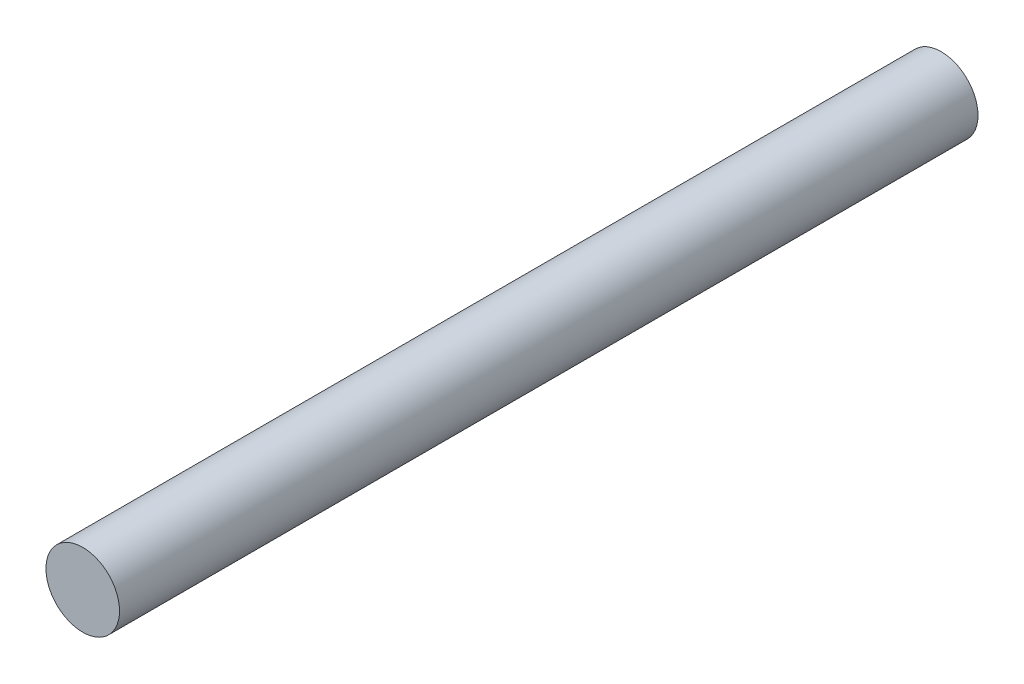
from build123d import *

# Parameters (mm, degrees)
SKETCH1_R           = 30
BOSS_EXTRUDE1_DEPTH = 700


with BuildPart() as part:
    # Sketch1 → Boss-Extrude1 (new body)
    with BuildSketch(Plane.XY):
        Circle(SKETCH1_R)
    extrude(amount=-BOSS_EXTRUDE1_DEPTH)


solid = part.part
